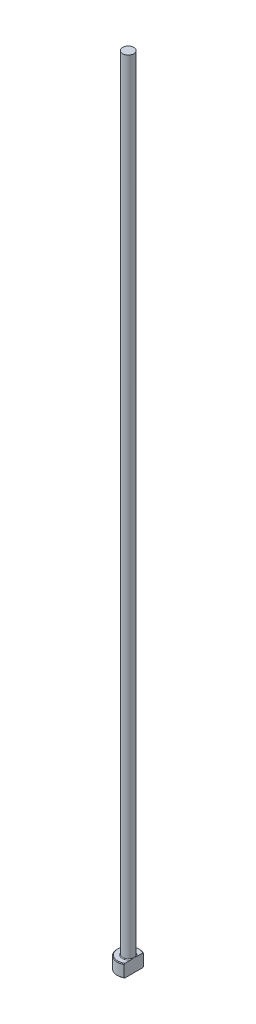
from build123d import *
from build123d.topology import SkipClean

# Parameters (mm, degrees)
CHAMFER1_SIZE    = 0.2
FILLET1_R        = 0.2
KEYED_HEAD_DEPTH = 251.048995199


with BuildPart() as part:
    # Sketch1 → Revolve1 (revolve)
    with BuildSketch(Plane.XY, mode=Mode.PRIVATE) as revolve1_sk:
        Polygon((0, 0), (-3.5, 0), (-3.5, 4), (-1.75, 4), (-1.75, 250), (0, 250), align=None)
    revolve(revolve1_sk.sketch.rotate(Axis((0, 259.958771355, 0), (0, -1, 0)), 270), axis=Axis((0, 259.958771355, 0), (0, -1, 0)))

    # Chamfer1
    chamfer1_edges = [part.edges().sort_by_distance(p)[0] for p in [
        (0, 4, -3.5),
        (0, 0, -3.5),
    ]]
    chamfer(chamfer1_edges, length=CHAMFER1_SIZE)

    # Fillet1
    fillet1_edges = [part.edges().sort_by_distance(p)[0] for p in [
        (0, 4, -1.75),
    ]]
    fillet(fillet1_edges, radius=FILLET1_R)

    # Sketch2 → KEYED HEAD (cut, through all)
    with SkipClean():  # the faces are left unmerged after this step: merging them gives an invalid solid
        with BuildSketch(Plane(origin=(0, 0, 0), x_dir=(1, 0, 0), z_dir=(0, 1, 0))):
            with BuildLine():
                Line((1.75, -3.031088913), (1.75, 3.031088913))
                ThreePointArc((1.75, 3.031088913), (3.5, 0), (1.75, -3.031088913))
            make_face()
        extrude(amount=KEYED_HEAD_DEPTH, mode=Mode.SUBTRACT)


solid = part.part
